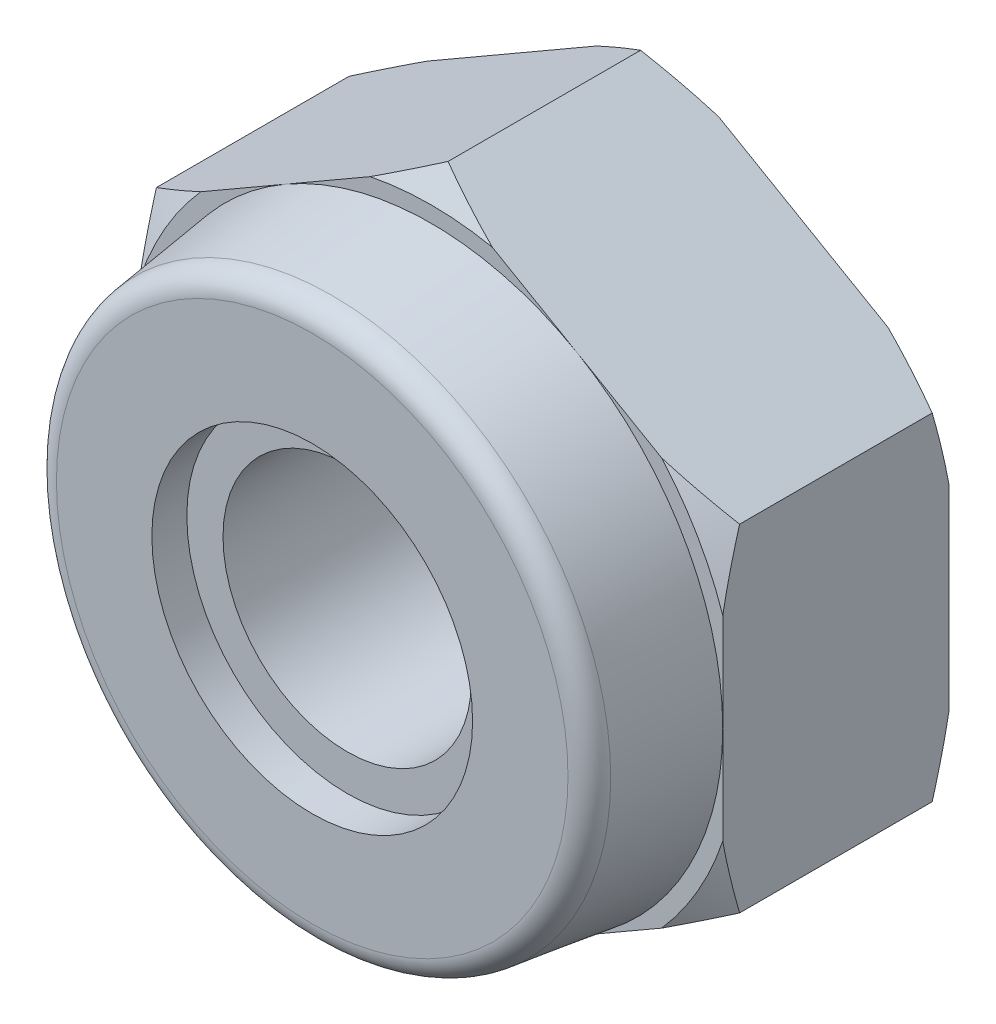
from build123d import *

# Parameters (mm, degrees)
BASENUTSKE_R  = 2.7051
BASENUT_DEPTH = 4.9276


with BuildPart() as part:
    # BaseNutSke → BaseNut (new body)
    with BuildSketch(Plane.XY):
        Polygon((6.35, -3.666174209), (6.35, 3.666174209), (0, 7.332348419), (-6.35, 3.666174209), (-6.35, -3.666174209), (0, -7.332348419), align=None)
        Circle(BASENUTSKE_R, mode=Mode.SUBTRACT)
    extrude(amount=-BASENUT_DEPTH)

    # TorqEleSke → TorqueElement (revolve)
    with BuildSketch(Plane(origin=(0, 0, 0), x_dir=(0, 0, -1), z_dir=(0, 1, 0)), mode=Mode.PRIVATE) as torqueelement_sk:
        with BuildLine():
            Line((-1.8288, 3.4925), (-1.8288, 2.7051))
            Line((-1.8288, 2.7051), (0, 2.7051))
            Line((0, 2.7051), (0, 6.35))
            Line((0, 6.35), (-2.156063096, 6.066148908))
            ThreePointArc((-2.156063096, 6.066148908), (-2.466719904, 5.900099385), (-2.5908, 5.570426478))
            Line((-2.5908, 5.570426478), (-2.5908, 3.4925))
            Line((-2.5908, 3.4925), (-1.8288, 3.4925))
        make_face()
    revolve(torqueelement_sk.sketch.rotate(Axis((0, 0, 9.480888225), (0, 0, -1)), 180), axis=Axis((0, 0, 9.480888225), (0, 0, -1)))

    # Sketch3 → DoubleChamfer (revolve, cut)
    with BuildSketch(Plane(origin=(0, 0, 0), x_dir=(0, 0, -1), z_dir=(1, 0, 0))):
        Polygon((4.9276, 6.697348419), (4.560982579, 7.332348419), (4.9276, 7.332348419), align=None)
        Polygon((0, 7.332348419), (0, 6.697348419), (0.366617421, 7.332348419), align=None)
    revolve(axis=Axis((0, 0, 0), (0, 0, -1)), mode=Mode.SUBTRACT)

    # ThdSchSke → ThreadSchematic (revolve, cut)
    with BuildSketch(Plane(origin=(0, 0, 0), x_dir=(1, 0, 0), z_dir=(0, 1, 0)), mode=Mode.PRIVATE) as threadschematic_sk:
        Polygon((-3.175, 4.9276), (-2.7051, 5.198896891), (-2.7051, 4.656303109), align=None)
    revolve(threadschematic_sk.sketch.rotate(Axis((0, 0, 1.481463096), (0, 0, 1)), 180), axis=Axis((0, 0, 1.481463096), (0, 0, 1)), mode=Mode.SUBTRACT)


solid = part.part
